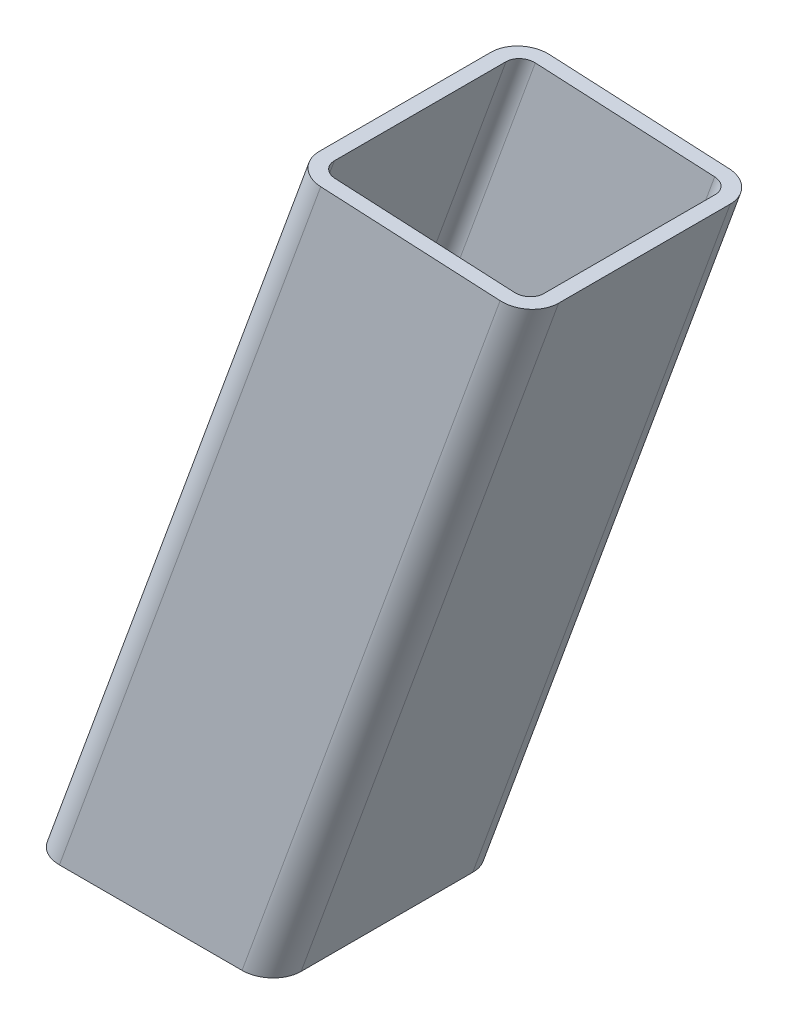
ISO-10303-21;
HEADER;
FILE_DESCRIPTION(('STEP AP214'),'2;1');
FILE_NAME('part.step','',(''),(''),'','','');
FILE_SCHEMA(('AUTOMOTIVE_DESIGN { 1 0 10303 214 1 1 1 1 }'));
ENDSEC;
DATA;
#1=APPLICATION_CONTEXT('core data for automotive mechanical design processes');
#2=APPLICATION_PROTOCOL_DEFINITION('international standard','automotive_design',2000,#1);
#3=PRODUCT_CONTEXT('',#1,'mechanical');
#4=PRODUCT('Part','Part','',(#3));
#5=PRODUCT_RELATED_PRODUCT_CATEGORY('part','',(#4));
#6=PRODUCT_DEFINITION_FORMATION('','',#4);
#7=PRODUCT_DEFINITION_CONTEXT('part definition',#1,'design');
#8=PRODUCT_DEFINITION('design','',#6,#7);
#9=PRODUCT_DEFINITION_SHAPE('','',#8);
#10=(LENGTH_UNIT() NAMED_UNIT(*) SI_UNIT(.MILLI.,.METRE.));
#11=(NAMED_UNIT(*) PLANE_ANGLE_UNIT() SI_UNIT($,.RADIAN.));
#12=(NAMED_UNIT(*) SI_UNIT($,.STERADIAN.) SOLID_ANGLE_UNIT());
#13=UNCERTAINTY_MEASURE_WITH_UNIT(LENGTH_MEASURE(1.E-05),#10,'distance_accuracy_value','');
#14=(GEOMETRIC_REPRESENTATION_CONTEXT(3) GLOBAL_UNCERTAINTY_ASSIGNED_CONTEXT((#13)) GLOBAL_UNIT_ASSIGNED_CONTEXT((#10,
#11,#12)) REPRESENTATION_CONTEXT('',''));
#15=CARTESIAN_POINT('',(0.,0.,0.));
#16=DIRECTION('',(0.,0.,1.));
#17=DIRECTION('',(1.,0.,0.));
#18=AXIS2_PLACEMENT_3D('',#15,#16,#17);
#19=CARTESIAN_POINT('',(1157.47473636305,369.296045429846,30.));
#20=DIRECTION('',(0.939692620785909,-0.342020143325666,0.));
#21=DIRECTION('',(0.342020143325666,0.93969262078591,0.));
#22=AXIS2_PLACEMENT_3D('',#19,#20,#21);
#23=PLANE('',#22);
#24=DIRECTION('',(0.,0.,-1.));
#25=VECTOR('',#24,1.);
#26=CARTESIAN_POINT('',(1043.80827154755,56.9999999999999,29.9999999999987));
#27=LINE('',#26,#25);
#28=CARTESIAN_POINT('',(1043.80827154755,57.0000000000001,30.));
#29=VERTEX_POINT('',#28);
#30=CARTESIAN_POINT('',(1043.80827154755,57.0000000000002,-30.));
#31=VERTEX_POINT('',#30);
#32=EDGE_CURVE('E184',#29,#31,#27,.T.);
#33=ORIENTED_EDGE('',*,*,#32,.F.);
#34=DIRECTION('',(-0.342020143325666,-0.939692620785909,0.));
#35=VECTOR('',#34,1.);
#36=CARTESIAN_POINT('',(1157.47473636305,369.296045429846,30.));
#37=LINE('',#36,#35);
#38=CARTESIAN_POINT('',(1135.361966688,308.541710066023,30.));
#39=VERTEX_POINT('',#38);
#40=EDGE_CURVE('E217',#39,#29,#37,.T.);
#41=ORIENTED_EDGE('',*,*,#40,.F.);
#42=DIRECTION('',(0.,0.,1.));
#43=VECTOR('',#42,1.);
#44=CARTESIAN_POINT('',(1135.361966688,308.541710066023,30.));
#45=LINE('',#44,#43);
#46=CARTESIAN_POINT('',(1135.361966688,308.541710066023,-30.));
#47=VERTEX_POINT('',#46);
#48=EDGE_CURVE('E227',#47,#39,#45,.T.);
#49=ORIENTED_EDGE('',*,*,#48,.F.);
#50=DIRECTION('',(-0.342020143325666,-0.939692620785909,0.));
#51=VECTOR('',#50,1.);
#52=CARTESIAN_POINT('',(1157.47473636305,369.296045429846,-30.));
#53=LINE('',#52,#51);
#54=EDGE_CURVE('E248',#47,#31,#53,.T.);
#55=ORIENTED_EDGE('',*,*,#54,.T.);
#56=EDGE_LOOP('',(#33,#41,#49,#55));
#57=FACE_BOUND('',#56,.T.);
#58=ADVANCED_FACE('F34',(#57),#23,.F.);
#59=CARTESIAN_POINT('',(1166.87166257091,365.875843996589,-30.));
#60=DIRECTION('',(-0.342020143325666,-0.939692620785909,0.));
#61=DIRECTION('',(0.93969262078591,-0.342020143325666,0.));
#62=AXIS2_PLACEMENT_3D('',#59,#60,#61);
#63=CYLINDRICAL_SURFACE('',#62,10.);
#64=CARTESIAN_POINT('',(1054.4500492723,57.0000000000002,-30.));
#65=DIRECTION('',(0.,-1.,0.));
#66=DIRECTION('',(-1.,0.,0.));
#67=AXIS2_PLACEMENT_3D('',#64,#65,#66);
#68=ELLIPSE('',#67,10.6417777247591,10.);
#69=CARTESIAN_POINT('',(1054.4500492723,57.0000000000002,-40.));
#70=VERTEX_POINT('',#69);
#71=EDGE_CURVE('E183',#31,#70,#68,.T.);
#72=ORIENTED_EDGE('',*,*,#71,.F.);
#73=ORIENTED_EDGE('',*,*,#54,.F.);
#74=CARTESIAN_POINT('',(1145.81328609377,308.018430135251,-30.));
#75=DIRECTION('',(0.0500056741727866,0.998748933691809,0.));
#76=DIRECTION('',(-0.998748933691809,0.0500056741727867,0.));
#77=AXIS2_PLACEMENT_3D('',#74,#75,#76);
#78=ELLIPSE('',#77,10.464411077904,10.);
#79=CARTESIAN_POINT('',(1145.81328609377,308.018430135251,-40.));
#80=VERTEX_POINT('',#79);
#81=EDGE_CURVE('E122',#80,#47,#78,.T.);
#82=ORIENTED_EDGE('',*,*,#81,.F.);
#83=DIRECTION('',(-0.342020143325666,-0.939692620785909,0.));
#84=VECTOR('',#83,1.);
#85=CARTESIAN_POINT('',(1166.87166257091,365.875843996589,-40.));
#86=LINE('',#85,#84);
#87=EDGE_CURVE('E245',#80,#70,#86,.T.);
#88=ORIENTED_EDGE('',*,*,#87,.T.);
#89=EDGE_LOOP('',(#72,#73,#82,#88));
#90=FACE_BOUND('',#89,.T.);
#91=ADVANCED_FACE('F308',(#90),#63,.T.);
#92=CARTESIAN_POINT('',(1223.25321981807,345.354635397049,-40.));
#93=DIRECTION('',(0.,0.,1.));
#94=DIRECTION('',(1.,0.,0.));
#95=AXIS2_PLACEMENT_3D('',#92,#93,#94);
#96=PLANE('',#95);
#97=DIRECTION('',(1.,0.,0.));
#98=VECTOR('',#97,1.);
#99=CARTESIAN_POINT('',(1223.25321981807,57.0000000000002,-40.));
#100=LINE('',#99,#98);
#101=CARTESIAN_POINT('',(1118.30071562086,57.0000000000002,-40.));
#102=VERTEX_POINT('',#101);
#103=EDGE_CURVE('E181',#70,#102,#100,.T.);
#104=ORIENTED_EDGE('',*,*,#103,.F.);
#105=ORIENTED_EDGE('',*,*,#87,.F.);
#106=DIRECTION('',(-0.998748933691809,0.0500056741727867,0.));
#107=VECTOR('',#106,1.);
#108=CARTESIAN_POINT('',(1221.1948896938,304.244200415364,-40.));
#109=LINE('',#108,#107);
#110=CARTESIAN_POINT('',(1208.52120252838,304.878750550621,-40.));
#111=VERTEX_POINT('',#110);
#112=EDGE_CURVE('E118',#111,#80,#109,.T.);
#113=ORIENTED_EDGE('',*,*,#112,.F.);
#114=DIRECTION('',(-0.342020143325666,-0.939692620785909,0.));
#115=VECTOR('',#114,1.);
#116=CARTESIAN_POINT('',(1223.25321981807,345.354635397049,-40.));
#117=LINE('',#116,#115);
#118=EDGE_CURVE('E242',#111,#102,#117,.T.);
#119=ORIENTED_EDGE('',*,*,#118,.T.);
#120=EDGE_LOOP('',(#104,#105,#113,#119));
#121=FACE_BOUND('',#120,.T.);
#122=ADVANCED_FACE('F306',(#121),#96,.F.);
#123=CARTESIAN_POINT('',(1223.25321981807,345.354635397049,-30.));
#124=DIRECTION('',(-0.342020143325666,-0.939692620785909,0.));
#125=DIRECTION('',(0.93969262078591,-0.342020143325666,0.));
#126=AXIS2_PLACEMENT_3D('',#123,#124,#125);
#127=CYLINDRICAL_SURFACE('',#126,10.);
#128=CARTESIAN_POINT('',(1118.30071562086,57.0000000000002,-30.));
#129=DIRECTION('',(0.,-1.,0.));
#130=DIRECTION('',(-1.,0.,0.));
#131=AXIS2_PLACEMENT_3D('',#128,#129,#130);
#132=ELLIPSE('',#131,10.6417777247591,10.);
#133=CARTESIAN_POINT('',(1128.94249334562,57.0000000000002,-30.));
#134=VERTEX_POINT('',#133);
#135=EDGE_CURVE('E179',#102,#134,#132,.T.);
#136=ORIENTED_EDGE('',*,*,#135,.F.);
#137=ORIENTED_EDGE('',*,*,#118,.F.);
#138=CARTESIAN_POINT('',(1208.52120252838,304.878750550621,-30.));
#139=DIRECTION('',(0.0500056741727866,0.998748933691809,0.));
#140=DIRECTION('',(-0.998748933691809,0.0500056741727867,0.));
#141=AXIS2_PLACEMENT_3D('',#138,#139,#140);
#142=ELLIPSE('',#141,10.4644110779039,10.);
#143=CARTESIAN_POINT('',(1218.97252193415,304.355470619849,-30.));
#144=VERTEX_POINT('',#143);
#145=EDGE_CURVE('E223',#144,#111,#142,.T.);
#146=ORIENTED_EDGE('',*,*,#145,.F.);
#147=DIRECTION('',(-0.342020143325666,-0.939692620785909,0.));
#148=VECTOR('',#147,1.);
#149=CARTESIAN_POINT('',(1232.65014602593,341.934433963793,-30.));
#150=LINE('',#149,#148);
#151=EDGE_CURVE('E239',#144,#134,#150,.T.);
#152=ORIENTED_EDGE('',*,*,#151,.T.);
#153=EDGE_LOOP('',(#136,#137,#146,#152));
#154=FACE_BOUND('',#153,.T.);
#155=ADVANCED_FACE('F301',(#154),#127,.T.);
#156=CARTESIAN_POINT('',(1232.65014602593,341.934433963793,-30.));
#157=DIRECTION('',(-0.939692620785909,0.342020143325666,0.));
#158=DIRECTION('',(-0.342020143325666,-0.93969262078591,0.));
#159=AXIS2_PLACEMENT_3D('',#156,#157,#158);
#160=PLANE('',#159);
#161=DIRECTION('',(0.,0.,1.));
#162=VECTOR('',#161,1.);
#163=CARTESIAN_POINT('',(1128.94249334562,57.0000000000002,-30.0000000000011));
#164=LINE('',#163,#162);
#165=CARTESIAN_POINT('',(1128.94249334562,56.9999999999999,30.));
#166=VERTEX_POINT('',#165);
#167=EDGE_CURVE('E173',#134,#166,#164,.T.);
#168=ORIENTED_EDGE('',*,*,#167,.F.);
#169=ORIENTED_EDGE('',*,*,#151,.F.);
#170=DIRECTION('',(0.,0.,-1.));
#171=VECTOR('',#170,1.);
#172=CARTESIAN_POINT('',(1218.97252193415,304.355470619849,-30.));
#173=LINE('',#172,#171);
#174=CARTESIAN_POINT('',(1218.97252193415,304.355470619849,30.));
#175=VERTEX_POINT('',#174);
#176=EDGE_CURVE('E221',#175,#144,#173,.T.);
#177=ORIENTED_EDGE('',*,*,#176,.F.);
#178=DIRECTION('',(-0.342020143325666,-0.939692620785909,0.));
#179=VECTOR('',#178,1.);
#180=CARTESIAN_POINT('',(1232.65014602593,341.934433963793,30.));
#181=LINE('',#180,#179);
#182=EDGE_CURVE('E236',#175,#166,#181,.T.);
#183=ORIENTED_EDGE('',*,*,#182,.T.);
#184=EDGE_LOOP('',(#168,#169,#177,#183));
#185=FACE_BOUND('',#184,.T.);
#186=ADVANCED_FACE('F298',(#185),#160,.F.);
#187=CARTESIAN_POINT('',(1223.25321981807,345.354635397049,30.));
#188=DIRECTION('',(-0.342020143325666,-0.939692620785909,0.));
#189=DIRECTION('',(0.93969262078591,-0.342020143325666,0.));
#190=AXIS2_PLACEMENT_3D('',#187,#188,#189);
#191=CYLINDRICAL_SURFACE('',#190,10.);
#192=CARTESIAN_POINT('',(1118.30071562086,56.9999999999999,30.));
#193=DIRECTION('',(0.,-1.,0.));
#194=DIRECTION('',(-1.,0.,0.));
#195=AXIS2_PLACEMENT_3D('',#192,#193,#194);
#196=ELLIPSE('',#195,10.6417777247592,10.);
#197=CARTESIAN_POINT('',(1118.30071562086,56.9999999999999,40.));
#198=VERTEX_POINT('',#197);
#199=EDGE_CURVE('E171',#166,#198,#196,.T.);
#200=ORIENTED_EDGE('',*,*,#199,.F.);
#201=ORIENTED_EDGE('',*,*,#182,.F.);
#202=CARTESIAN_POINT('',(1208.52120252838,304.878750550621,30.));
#203=DIRECTION('',(0.0500056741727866,0.998748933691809,0.));
#204=DIRECTION('',(-0.998748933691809,0.0500056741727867,0.));
#205=AXIS2_PLACEMENT_3D('',#202,#203,#204);
#206=ELLIPSE('',#205,10.464411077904,10.);
#207=CARTESIAN_POINT('',(1208.52120252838,304.878750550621,40.));
#208=VERTEX_POINT('',#207);
#209=EDGE_CURVE('E219',#208,#175,#206,.T.);
#210=ORIENTED_EDGE('',*,*,#209,.F.);
#211=DIRECTION('',(-0.342020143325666,-0.939692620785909,0.));
#212=VECTOR('',#211,1.);
#213=CARTESIAN_POINT('',(1223.25321981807,345.354635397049,40.));
#214=LINE('',#213,#212);
#215=EDGE_CURVE('E233',#208,#198,#214,.T.);
#216=ORIENTED_EDGE('',*,*,#215,.T.);
#217=EDGE_LOOP('',(#200,#201,#210,#216));
#218=FACE_BOUND('',#217,.T.);
#219=ADVANCED_FACE('F291',(#218),#191,.T.);
#220=CARTESIAN_POINT('',(1166.87166257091,365.875843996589,40.));
#221=DIRECTION('',(0.,0.,-1.));
#222=DIRECTION('',(-1.,0.,0.));
#223=AXIS2_PLACEMENT_3D('',#220,#221,#222);
#224=PLANE('',#223);
#225=DIRECTION('',(-1.,0.,0.));
#226=VECTOR('',#225,1.);
#227=CARTESIAN_POINT('',(1166.87166257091,56.9999999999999,40.));
#228=LINE('',#227,#226);
#229=CARTESIAN_POINT('',(1054.4500492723,56.9999999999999,40.));
#230=VERTEX_POINT('',#229);
#231=EDGE_CURVE('E53',#198,#230,#228,.T.);
#232=ORIENTED_EDGE('',*,*,#231,.F.);
#233=ORIENTED_EDGE('',*,*,#215,.F.);
#234=DIRECTION('',(0.998748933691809,-0.0500056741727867,0.));
#235=VECTOR('',#234,1.);
#236=CARTESIAN_POINT('',(1163.9294252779,307.111385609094,40.));
#237=LINE('',#236,#235);
#238=CARTESIAN_POINT('',(1145.81328609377,308.018430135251,40.));
#239=VERTEX_POINT('',#238);
#240=EDGE_CURVE('E216',#239,#208,#237,.T.);
#241=ORIENTED_EDGE('',*,*,#240,.F.);
#242=DIRECTION('',(-0.342020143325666,-0.939692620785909,0.));
#243=VECTOR('',#242,1.);
#244=CARTESIAN_POINT('',(1166.87166257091,365.875843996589,40.));
#245=LINE('',#244,#243);
#246=EDGE_CURVE('E230',#239,#230,#245,.T.);
#247=ORIENTED_EDGE('',*,*,#246,.T.);
#248=EDGE_LOOP('',(#232,#233,#241,#247));
#249=FACE_BOUND('',#248,.T.);
#250=ADVANCED_FACE('F288',(#249),#224,.F.);
#251=CARTESIAN_POINT('',(1166.87166257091,365.875843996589,30.));
#252=DIRECTION('',(-0.342020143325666,-0.939692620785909,0.));
#253=DIRECTION('',(0.93969262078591,-0.342020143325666,0.));
#254=AXIS2_PLACEMENT_3D('',#251,#252,#253);
#255=CYLINDRICAL_SURFACE('',#254,10.);
#256=CARTESIAN_POINT('',(1054.4500492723,56.9999999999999,30.));
#257=DIRECTION('',(0.,-1.,0.));
#258=DIRECTION('',(-1.,0.,0.));
#259=AXIS2_PLACEMENT_3D('',#256,#257,#258);
#260=ELLIPSE('',#259,10.6417777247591,10.);
#261=EDGE_CURVE('E176',#230,#29,#260,.T.);
#262=ORIENTED_EDGE('',*,*,#261,.F.);
#263=ORIENTED_EDGE('',*,*,#246,.F.);
#264=CARTESIAN_POINT('',(1145.81328609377,308.018430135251,30.));
#265=DIRECTION('',(0.0500056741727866,0.998748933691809,0.));
#266=DIRECTION('',(-0.998748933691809,0.0500056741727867,0.));
#267=AXIS2_PLACEMENT_3D('',#264,#265,#266);
#268=ELLIPSE('',#267,10.464411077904,10.);
#269=EDGE_CURVE('E214',#39,#239,#268,.T.);
#270=ORIENTED_EDGE('',*,*,#269,.F.);
#271=ORIENTED_EDGE('',*,*,#40,.T.);
#272=EDGE_LOOP('',(#262,#263,#270,#271));
#273=FACE_BOUND('',#272,.T.);
#274=ADVANCED_FACE('F36',(#273),#255,.T.);
#275=CARTESIAN_POINT('',(6158.08276398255,57.0625533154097,-40.));
#276=DIRECTION('',(0.0500056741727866,0.998748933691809,0.));
#277=DIRECTION('',(-0.998748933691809,0.0500056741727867,0.));
#278=AXIS2_PLACEMENT_3D('',#275,#276,#277);
#279=PLANE('',#278);
#280=DIRECTION('',(0.998748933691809,-0.0500056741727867,0.));
#281=VECTOR('',#280,1.);
#282=CARTESIAN_POINT('',(1163.9294252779,307.111385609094,35.));
#283=LINE('',#282,#281);
#284=CARTESIAN_POINT('',(1145.81328609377,308.018430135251,35.));
#285=VERTEX_POINT('',#284);
#286=CARTESIAN_POINT('',(1208.52120252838,304.878750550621,35.));
#287=VERTEX_POINT('',#286);
#288=EDGE_CURVE('E186',#285,#287,#283,.T.);
#289=ORIENTED_EDGE('',*,*,#288,.F.);
#290=CARTESIAN_POINT('',(1145.81328609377,308.018430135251,30.));
#291=DIRECTION('',(0.0500056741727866,0.998748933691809,0.));
#292=DIRECTION('',(-0.998748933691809,0.0500056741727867,0.));
#293=AXIS2_PLACEMENT_3D('',#290,#291,#292);
#294=ELLIPSE('',#293,5.23220553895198,5.00000000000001);
#295=CARTESIAN_POINT('',(1140.58762639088,308.280070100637,30.));
#296=VERTEX_POINT('',#295);
#297=EDGE_CURVE('E191',#296,#285,#294,.T.);
#298=ORIENTED_EDGE('',*,*,#297,.F.);
#299=DIRECTION('',(0.,0.,1.));
#300=VECTOR('',#299,1.);
#301=CARTESIAN_POINT('',(1140.58762639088,308.280070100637,30.));
#302=LINE('',#301,#300);
#303=CARTESIAN_POINT('',(1140.58762639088,308.280070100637,-30.));
#304=VERTEX_POINT('',#303);
#305=EDGE_CURVE('E196',#304,#296,#302,.T.);
#306=ORIENTED_EDGE('',*,*,#305,.F.);
#307=CARTESIAN_POINT('',(1145.81328609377,308.018430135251,-30.));
#308=DIRECTION('',(0.0500056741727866,0.998748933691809,0.));
#309=DIRECTION('',(-0.998748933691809,0.0500056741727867,0.));
#310=AXIS2_PLACEMENT_3D('',#307,#308,#309);
#311=ELLIPSE('',#310,5.23220553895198,5.00000000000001);
#312=CARTESIAN_POINT('',(1145.81328609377,308.018430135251,-35.));
#313=VERTEX_POINT('',#312);
#314=EDGE_CURVE('E201',#313,#304,#311,.T.);
#315=ORIENTED_EDGE('',*,*,#314,.F.);
#316=DIRECTION('',(-0.998748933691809,0.0500056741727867,0.));
#317=VECTOR('',#316,1.);
#318=CARTESIAN_POINT('',(1221.1948896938,304.244200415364,-35.));
#319=LINE('',#318,#317);
#320=CARTESIAN_POINT('',(1208.52120252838,304.878750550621,-35.));
#321=VERTEX_POINT('',#320);
#322=EDGE_CURVE('E206',#321,#313,#319,.T.);
#323=ORIENTED_EDGE('',*,*,#322,.F.);
#324=CARTESIAN_POINT('',(1208.52120252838,304.878750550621,-30.));
#325=DIRECTION('',(0.0500056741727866,0.998748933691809,0.));
#326=DIRECTION('',(-0.998748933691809,0.0500056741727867,0.));
#327=AXIS2_PLACEMENT_3D('',#324,#325,#326);
#328=ELLIPSE('',#327,5.23220553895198,5.00000000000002);
#329=CARTESIAN_POINT('',(1213.74686223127,304.617110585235,-30.));
#330=VERTEX_POINT('',#329);
#331=EDGE_CURVE('E167',#330,#321,#328,.T.);
#332=ORIENTED_EDGE('',*,*,#331,.F.);
#333=DIRECTION('',(0.,0.,-1.));
#334=VECTOR('',#333,1.);
#335=CARTESIAN_POINT('',(1213.74686223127,304.617110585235,-30.));
#336=LINE('',#335,#334);
#337=CARTESIAN_POINT('',(1213.74686223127,304.617110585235,30.));
#338=VERTEX_POINT('',#337);
#339=EDGE_CURVE('E158',#338,#330,#336,.T.);
#340=ORIENTED_EDGE('',*,*,#339,.F.);
#341=CARTESIAN_POINT('',(1208.52120252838,304.878750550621,30.));
#342=DIRECTION('',(0.0500056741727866,0.998748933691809,0.));
#343=DIRECTION('',(-0.998748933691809,0.0500056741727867,0.));
#344=AXIS2_PLACEMENT_3D('',#341,#342,#343);
#345=ELLIPSE('',#344,5.23220553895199,5.00000000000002);
#346=EDGE_CURVE('E11',#287,#338,#345,.T.);
#347=ORIENTED_EDGE('',*,*,#346,.F.);
#348=EDGE_LOOP('',(#289,#298,#306,#315,#323,#332,#340,#347));
#349=FACE_BOUND('',#348,.T.);
#350=ORIENTED_EDGE('',*,*,#269,.T.);
#351=ORIENTED_EDGE('',*,*,#240,.T.);
#352=ORIENTED_EDGE('',*,*,#209,.T.);
#353=ORIENTED_EDGE('',*,*,#176,.T.);
#354=ORIENTED_EDGE('',*,*,#145,.T.);
#355=ORIENTED_EDGE('',*,*,#112,.T.);
#356=ORIENTED_EDGE('',*,*,#81,.T.);
#357=ORIENTED_EDGE('',*,*,#48,.T.);
#358=EDGE_LOOP('',(#350,#351,#352,#353,#354,#355,#356,#357));
#359=FACE_BOUND('',#358,.T.);
#360=ADVANCED_FACE('F284',(#349,#359),#279,.T.);
#361=CARTESIAN_POINT('',(9149.96897120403,57.0000000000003,-59.9999999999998));
#362=DIRECTION('',(0.,-1.,0.));
#363=DIRECTION('',(0.,0.,-1.));
#364=AXIS2_PLACEMENT_3D('',#361,#362,#363);
#365=PLANE('',#364);
#366=DIRECTION('',(0.,0.,1.));
#367=VECTOR('',#366,1.);
#368=CARTESIAN_POINT('',(1123.62160448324,57.0000000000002,-30.0000000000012));
#369=LINE('',#368,#367);
#370=CARTESIAN_POINT('',(1123.62160448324,57.0000000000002,-30.));
#371=VERTEX_POINT('',#370);
#372=CARTESIAN_POINT('',(1123.62160448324,57.0000000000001,30.));
#373=VERTEX_POINT('',#372);
#374=EDGE_CURVE('E151',#371,#373,#369,.T.);
#375=ORIENTED_EDGE('',*,*,#374,.F.);
#376=CARTESIAN_POINT('',(1118.30071562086,57.0000000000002,-30.));
#377=DIRECTION('',(0.,-1.,0.));
#378=DIRECTION('',(-1.,0.,0.));
#379=AXIS2_PLACEMENT_3D('',#376,#377,#378);
#380=ELLIPSE('',#379,5.32088886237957,5.00000000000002);
#381=CARTESIAN_POINT('',(1118.30071562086,57.0000000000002,-35.));
#382=VERTEX_POINT('',#381);
#383=EDGE_CURVE('E147',#382,#371,#380,.T.);
#384=ORIENTED_EDGE('',*,*,#383,.F.);
#385=DIRECTION('',(1.,0.,0.));
#386=VECTOR('',#385,1.);
#387=CARTESIAN_POINT('',(1223.25321981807,57.0000000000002,-35.));
#388=LINE('',#387,#386);
#389=CARTESIAN_POINT('',(1054.4500492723,57.0000000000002,-35.));
#390=VERTEX_POINT('',#389);
#391=EDGE_CURVE('E210',#390,#382,#388,.T.);
#392=ORIENTED_EDGE('',*,*,#391,.F.);
#393=CARTESIAN_POINT('',(1054.4500492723,57.0000000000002,-30.));
#394=DIRECTION('',(0.,-1.,0.));
#395=DIRECTION('',(-1.,0.,0.));
#396=AXIS2_PLACEMENT_3D('',#393,#394,#395);
#397=ELLIPSE('',#396,5.32088886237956,5.00000000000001);
#398=CARTESIAN_POINT('',(1049.12916040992,57.0000000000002,-30.));
#399=VERTEX_POINT('',#398);
#400=EDGE_CURVE('E205',#399,#390,#397,.T.);
#401=ORIENTED_EDGE('',*,*,#400,.F.);
#402=DIRECTION('',(0.,0.,-1.));
#403=VECTOR('',#402,1.);
#404=CARTESIAN_POINT('',(1049.12916040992,56.9999999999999,29.9999999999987));
#405=LINE('',#404,#403);
#406=CARTESIAN_POINT('',(1049.12916040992,56.9999999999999,30.));
#407=VERTEX_POINT('',#406);
#408=EDGE_CURVE('E200',#407,#399,#405,.T.);
#409=ORIENTED_EDGE('',*,*,#408,.F.);
#410=CARTESIAN_POINT('',(1054.4500492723,56.9999999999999,30.));
#411=DIRECTION('',(0.,-1.,0.));
#412=DIRECTION('',(-1.,0.,0.));
#413=AXIS2_PLACEMENT_3D('',#410,#411,#412);
#414=ELLIPSE('',#413,5.32088886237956,5.00000000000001);
#415=CARTESIAN_POINT('',(1054.4500492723,56.9999999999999,35.));
#416=VERTEX_POINT('',#415);
#417=EDGE_CURVE('E195',#416,#407,#414,.T.);
#418=ORIENTED_EDGE('',*,*,#417,.F.);
#419=DIRECTION('',(-1.,0.,0.));
#420=VECTOR('',#419,1.);
#421=CARTESIAN_POINT('',(1166.87166257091,56.9999999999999,35.));
#422=LINE('',#421,#420);
#423=CARTESIAN_POINT('',(1118.30071562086,56.9999999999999,35.));
#424=VERTEX_POINT('',#423);
#425=EDGE_CURVE('E190',#424,#416,#422,.T.);
#426=ORIENTED_EDGE('',*,*,#425,.F.);
#427=CARTESIAN_POINT('',(1118.30071562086,56.9999999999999,30.));
#428=DIRECTION('',(0.,-1.,0.));
#429=DIRECTION('',(-1.,0.,0.));
#430=AXIS2_PLACEMENT_3D('',#427,#428,#429);
#431=ELLIPSE('',#430,5.32088886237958,5.00000000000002);
#432=EDGE_CURVE('E44',#373,#424,#431,.T.);
#433=ORIENTED_EDGE('',*,*,#432,.F.);
#434=EDGE_LOOP('',(#375,#384,#392,#401,#409,#418,#426,#433));
#435=FACE_BOUND('',#434,.T.);
#436=ORIENTED_EDGE('',*,*,#261,.T.);
#437=ORIENTED_EDGE('',*,*,#32,.T.);
#438=ORIENTED_EDGE('',*,*,#71,.T.);
#439=ORIENTED_EDGE('',*,*,#103,.T.);
#440=ORIENTED_EDGE('',*,*,#135,.T.);
#441=ORIENTED_EDGE('',*,*,#167,.T.);
#442=ORIENTED_EDGE('',*,*,#199,.T.);
#443=ORIENTED_EDGE('',*,*,#231,.T.);
#444=EDGE_LOOP('',(#436,#437,#438,#439,#440,#441,#442,#443));
#445=FACE_BOUND('',#444,.T.);
#446=ADVANCED_FACE('F152',(#435,#445),#365,.T.);
#447=CARTESIAN_POINT('',(1227.951682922,343.644534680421,-30.));
#448=DIRECTION('',(-0.939692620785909,0.342020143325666,0.));
#449=DIRECTION('',(-0.342020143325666,-0.93969262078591,0.));
#450=AXIS2_PLACEMENT_3D('',#447,#448,#449);
#451=PLANE('',#450);
#452=DIRECTION('',(-0.342020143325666,-0.939692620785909,0.));
#453=VECTOR('',#452,1.);
#454=CARTESIAN_POINT('',(1227.951682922,343.644534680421,-30.));
#455=LINE('',#454,#453);
#456=EDGE_CURVE('E38',#330,#371,#455,.T.);
#457=ORIENTED_EDGE('',*,*,#456,.T.);
#458=ORIENTED_EDGE('',*,*,#374,.T.);
#459=DIRECTION('',(-0.342020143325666,-0.939692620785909,0.));
#460=VECTOR('',#459,1.);
#461=CARTESIAN_POINT('',(1227.951682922,343.644534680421,30.));
#462=LINE('',#461,#460);
#463=EDGE_CURVE('E189',#338,#373,#462,.T.);
#464=ORIENTED_EDGE('',*,*,#463,.F.);
#465=ORIENTED_EDGE('',*,*,#339,.T.);
#466=EDGE_LOOP('',(#457,#458,#464,#465));
#467=FACE_BOUND('',#466,.T.);
#468=ADVANCED_FACE('F170',(#467),#451,.T.);
#469=CARTESIAN_POINT('',(1223.25321981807,345.354635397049,-30.));
#470=DIRECTION('',(-0.342020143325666,-0.939692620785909,0.));
#471=DIRECTION('',(0.93969262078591,-0.342020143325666,0.));
#472=AXIS2_PLACEMENT_3D('',#469,#470,#471);
#473=CYLINDRICAL_SURFACE('',#472,5.00000000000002);
#474=DIRECTION('',(-0.342020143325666,-0.939692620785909,0.));
#475=VECTOR('',#474,1.);
#476=CARTESIAN_POINT('',(1223.25321981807,345.354635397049,-35.));
#477=LINE('',#476,#475);
#478=EDGE_CURVE('E166',#321,#382,#477,.T.);
#479=ORIENTED_EDGE('',*,*,#478,.T.);
#480=ORIENTED_EDGE('',*,*,#383,.T.);
#481=ORIENTED_EDGE('',*,*,#456,.F.);
#482=ORIENTED_EDGE('',*,*,#331,.T.);
#483=EDGE_LOOP('',(#479,#480,#481,#482));
#484=FACE_BOUND('',#483,.T.);
#485=ADVANCED_FACE('F163',(#484),#473,.F.);
#486=CARTESIAN_POINT('',(1223.25321981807,345.354635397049,-35.));
#487=DIRECTION('',(0.,0.,1.));
#488=DIRECTION('',(1.,0.,0.));
#489=AXIS2_PLACEMENT_3D('',#486,#487,#488);
#490=PLANE('',#489);
#491=DIRECTION('',(-0.342020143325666,-0.939692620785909,0.));
#492=VECTOR('',#491,1.);
#493=CARTESIAN_POINT('',(1166.87166257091,365.875843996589,-35.));
#494=LINE('',#493,#492);
#495=EDGE_CURVE('E212',#313,#390,#494,.T.);
#496=ORIENTED_EDGE('',*,*,#495,.T.);
#497=ORIENTED_EDGE('',*,*,#391,.T.);
#498=ORIENTED_EDGE('',*,*,#478,.F.);
#499=ORIENTED_EDGE('',*,*,#322,.T.);
#500=EDGE_LOOP('',(#496,#497,#498,#499));
#501=FACE_BOUND('',#500,.T.);
#502=ADVANCED_FACE('F342',(#501),#490,.T.);
#503=CARTESIAN_POINT('',(1166.87166257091,365.875843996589,-30.));
#504=DIRECTION('',(-0.342020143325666,-0.939692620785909,0.));
#505=DIRECTION('',(0.93969262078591,-0.342020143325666,0.));
#506=AXIS2_PLACEMENT_3D('',#503,#504,#505);
#507=CYLINDRICAL_SURFACE('',#506,5.00000000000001);
#508=DIRECTION('',(-0.342020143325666,-0.939692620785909,0.));
#509=VECTOR('',#508,1.);
#510=CARTESIAN_POINT('',(1162.17319946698,367.585944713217,-30.));
#511=LINE('',#510,#509);
#512=EDGE_CURVE('E209',#304,#399,#511,.T.);
#513=ORIENTED_EDGE('',*,*,#512,.T.);
#514=ORIENTED_EDGE('',*,*,#400,.T.);
#515=ORIENTED_EDGE('',*,*,#495,.F.);
#516=ORIENTED_EDGE('',*,*,#314,.T.);
#517=EDGE_LOOP('',(#513,#514,#515,#516));
#518=FACE_BOUND('',#517,.T.);
#519=ADVANCED_FACE('F345',(#518),#507,.F.);
#520=CARTESIAN_POINT('',(1162.17319946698,367.585944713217,30.));
#521=DIRECTION('',(0.939692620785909,-0.342020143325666,0.));
#522=DIRECTION('',(0.342020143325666,0.93969262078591,0.));
#523=AXIS2_PLACEMENT_3D('',#520,#521,#522);
#524=PLANE('',#523);
#525=DIRECTION('',(-0.342020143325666,-0.939692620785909,0.));
#526=VECTOR('',#525,1.);
#527=CARTESIAN_POINT('',(1162.17319946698,367.585944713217,30.));
#528=LINE('',#527,#526);
#529=EDGE_CURVE('E204',#296,#407,#528,.T.);
#530=ORIENTED_EDGE('',*,*,#529,.T.);
#531=ORIENTED_EDGE('',*,*,#408,.T.);
#532=ORIENTED_EDGE('',*,*,#512,.F.);
#533=ORIENTED_EDGE('',*,*,#305,.T.);
#534=EDGE_LOOP('',(#530,#531,#532,#533));
#535=FACE_BOUND('',#534,.T.);
#536=ADVANCED_FACE('F348',(#535),#524,.T.);
#537=CARTESIAN_POINT('',(1166.87166257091,365.875843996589,30.));
#538=DIRECTION('',(-0.342020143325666,-0.939692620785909,0.));
#539=DIRECTION('',(0.93969262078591,-0.342020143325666,0.));
#540=AXIS2_PLACEMENT_3D('',#537,#538,#539);
#541=CYLINDRICAL_SURFACE('',#540,5.00000000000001);
#542=DIRECTION('',(-0.342020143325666,-0.939692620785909,0.));
#543=VECTOR('',#542,1.);
#544=CARTESIAN_POINT('',(1166.87166257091,365.875843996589,35.));
#545=LINE('',#544,#543);
#546=EDGE_CURVE('E199',#285,#416,#545,.T.);
#547=ORIENTED_EDGE('',*,*,#546,.T.);
#548=ORIENTED_EDGE('',*,*,#417,.T.);
#549=ORIENTED_EDGE('',*,*,#529,.F.);
#550=ORIENTED_EDGE('',*,*,#297,.T.);
#551=EDGE_LOOP('',(#547,#548,#549,#550));
#552=FACE_BOUND('',#551,.T.);
#553=ADVANCED_FACE('F352',(#552),#541,.F.);
#554=CARTESIAN_POINT('',(1166.87166257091,365.875843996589,35.));
#555=DIRECTION('',(0.,0.,-1.));
#556=DIRECTION('',(-1.,0.,0.));
#557=AXIS2_PLACEMENT_3D('',#554,#555,#556);
#558=PLANE('',#557);
#559=DIRECTION('',(-0.342020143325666,-0.939692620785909,0.));
#560=VECTOR('',#559,1.);
#561=CARTESIAN_POINT('',(1223.25321981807,345.354635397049,35.));
#562=LINE('',#561,#560);
#563=EDGE_CURVE('E194',#287,#424,#562,.T.);
#564=ORIENTED_EDGE('',*,*,#563,.T.);
#565=ORIENTED_EDGE('',*,*,#425,.T.);
#566=ORIENTED_EDGE('',*,*,#546,.F.);
#567=ORIENTED_EDGE('',*,*,#288,.T.);
#568=EDGE_LOOP('',(#564,#565,#566,#567));
#569=FACE_BOUND('',#568,.T.);
#570=ADVANCED_FACE('F356',(#569),#558,.T.);
#571=CARTESIAN_POINT('',(1223.25321981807,345.354635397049,30.));
#572=DIRECTION('',(-0.342020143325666,-0.939692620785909,0.));
#573=DIRECTION('',(0.93969262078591,-0.342020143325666,0.));
#574=AXIS2_PLACEMENT_3D('',#571,#572,#573);
#575=CYLINDRICAL_SURFACE('',#574,5.00000000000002);
#576=ORIENTED_EDGE('',*,*,#463,.T.);
#577=ORIENTED_EDGE('',*,*,#432,.T.);
#578=ORIENTED_EDGE('',*,*,#563,.F.);
#579=ORIENTED_EDGE('',*,*,#346,.T.);
#580=EDGE_LOOP('',(#576,#577,#578,#579));
#581=FACE_BOUND('',#580,.T.);
#582=ADVANCED_FACE('F359',(#581),#575,.F.);
#583=CLOSED_SHELL('',(#58,#91,#122,#155,#186,#219,#250,#274,#360,#446,#468,#485,#502,#519,#536,
#553,#570,#582));
#584=MANIFOLD_SOLID_BREP('B2',#583);
#585=ADVANCED_BREP_SHAPE_REPRESENTATION('',(#18,#584),#14);
#586=SHAPE_DEFINITION_REPRESENTATION(#9,#585);
ENDSEC;
END-ISO-10303-21;
